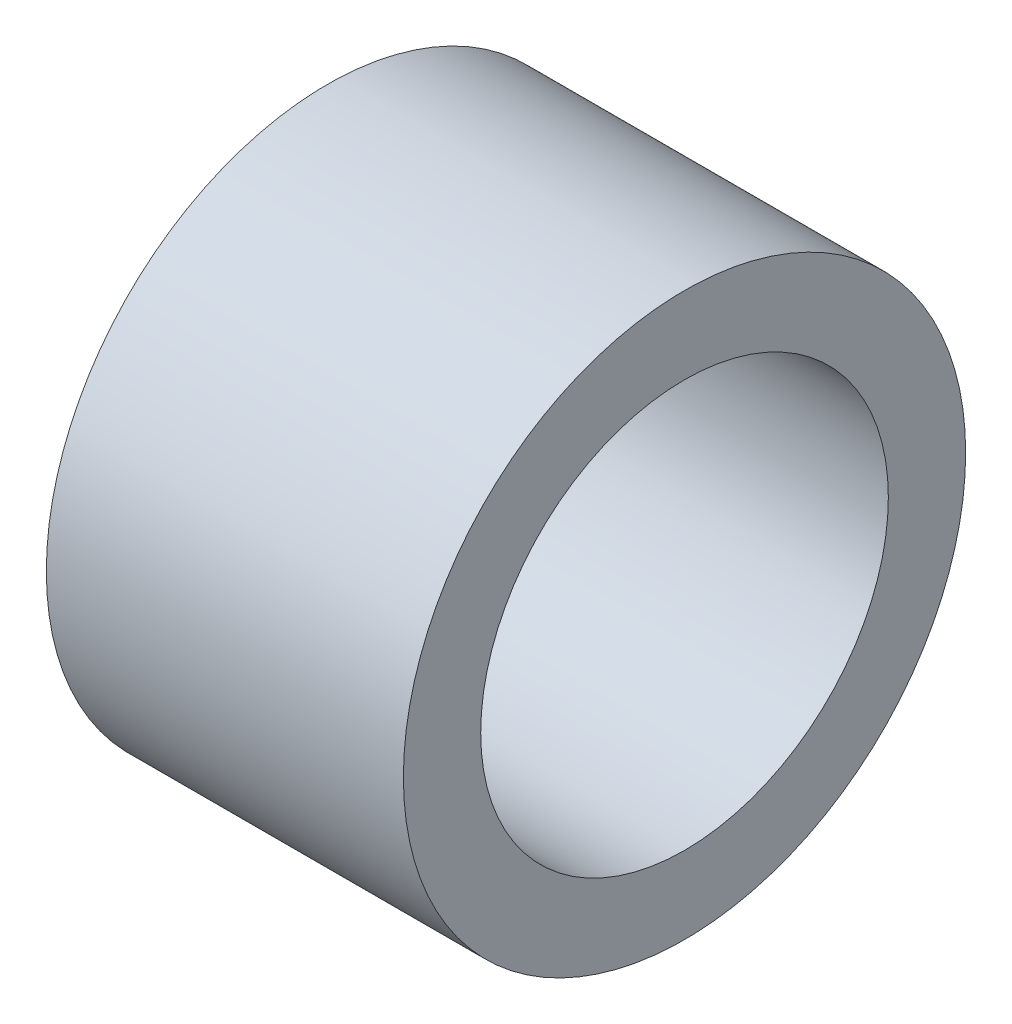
from build123d import *

# Parameters (mm, degrees)
SKETCH1_R           = 2
SKETCH1_R_2         = 1.45
BOSS_EXTRUDE1_DEPTH = 2.54


with BuildPart() as part:
    # Sketch1 → Boss-Extrude1 (new body)
    with BuildSketch(Plane(origin=(0, 0, 0), x_dir=(0, 0, -1), z_dir=(1, 0, 0))):
        Circle(SKETCH1_R)
        Circle(SKETCH1_R_2, mode=Mode.SUBTRACT)
    extrude(amount=BOSS_EXTRUDE1_DEPTH)


solid = part.part
